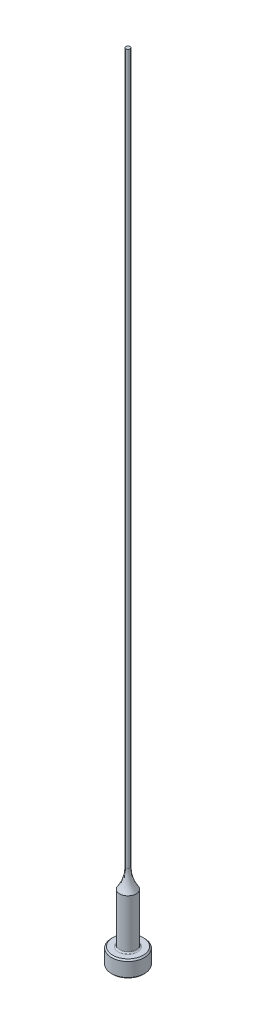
ISO-10303-21;
HEADER;
FILE_DESCRIPTION(('STEP AP214'),'2;1');
FILE_NAME('part.step','',(''),(''),'','','');
FILE_SCHEMA(('AUTOMOTIVE_DESIGN { 1 0 10303 214 1 1 1 1 }'));
ENDSEC;
DATA;
#1=APPLICATION_CONTEXT('core data for automotive mechanical design processes');
#2=APPLICATION_PROTOCOL_DEFINITION('international standard','automotive_design',2000,#1);
#3=PRODUCT_CONTEXT('',#1,'mechanical');
#4=PRODUCT('Part','Part','',(#3));
#5=PRODUCT_RELATED_PRODUCT_CATEGORY('part','',(#4));
#6=PRODUCT_DEFINITION_FORMATION('','',#4);
#7=PRODUCT_DEFINITION_CONTEXT('part definition',#1,'design');
#8=PRODUCT_DEFINITION('design','',#6,#7);
#9=PRODUCT_DEFINITION_SHAPE('','',#8);
#10=(LENGTH_UNIT() NAMED_UNIT(*) SI_UNIT(.MILLI.,.METRE.));
#11=(NAMED_UNIT(*) PLANE_ANGLE_UNIT() SI_UNIT($,.RADIAN.));
#12=(NAMED_UNIT(*) SI_UNIT($,.STERADIAN.) SOLID_ANGLE_UNIT());
#13=UNCERTAINTY_MEASURE_WITH_UNIT(LENGTH_MEASURE(1.E-05),#10,'distance_accuracy_value','');
#14=(GEOMETRIC_REPRESENTATION_CONTEXT(3) GLOBAL_UNCERTAINTY_ASSIGNED_CONTEXT((#13)) GLOBAL_UNIT_ASSIGNED_CONTEXT((#10,
#11,#12)) REPRESENTATION_CONTEXT('',''));
#15=CARTESIAN_POINT('',(0.,0.,0.));
#16=DIRECTION('',(0.,0.,1.));
#17=DIRECTION('',(1.,0.,0.));
#18=AXIS2_PLACEMENT_3D('',#15,#16,#17);
#19=CARTESIAN_POINT('',(-0.396239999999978,152.4,0.));
#20=DIRECTION('',(0.,1.,0.));
#21=DIRECTION('',(0.,0.,1.));
#22=AXIS2_PLACEMENT_3D('',#19,#20,#21);
#23=PLANE('',#22);
#24=CARTESIAN_POINT('',(0.,152.4,0.));
#25=DIRECTION('',(0.,1.,0.));
#26=DIRECTION('',(0.,0.,1.));
#27=AXIS2_PLACEMENT_3D('',#24,#25,#26);
#28=CIRCLE('',#27,0.396239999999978);
#29=CARTESIAN_POINT('',(0.,152.4,0.396239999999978));
#30=VERTEX_POINT('',#29);
#31=EDGE_CURVE('E56',#30,#30,#28,.T.);
#32=ORIENTED_EDGE('',*,*,#31,.T.);
#33=EDGE_LOOP('',(#32));
#34=FACE_BOUND('',#33,.T.);
#35=ADVANCED_FACE('F30',(#34),#23,.T.);
#36=CARTESIAN_POINT('',(0.,259.958771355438,0.));
#37=DIRECTION('',(0.,1.,0.));
#38=DIRECTION('',(0.,0.,1.));
#39=AXIS2_PLACEMENT_3D('',#36,#37,#38);
#40=CYLINDRICAL_SURFACE('',#39,0.396239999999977);
#41=CARTESIAN_POINT('',(0.,16.4026884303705,0.));
#42=DIRECTION('',(0.,1.,0.));
#43=DIRECTION('',(0.,0.,1.));
#44=AXIS2_PLACEMENT_3D('',#41,#42,#43);
#45=CIRCLE('',#44,0.396239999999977);
#46=CARTESIAN_POINT('',(0.,16.4026884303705,0.396239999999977));
#47=VERTEX_POINT('',#46);
#48=EDGE_CURVE('E59',#47,#47,#45,.T.);
#49=ORIENTED_EDGE('',*,*,#48,.T.);
#50=EDGE_LOOP('',(#49));
#51=FACE_BOUND('',#50,.T.);
#52=ORIENTED_EDGE('',*,*,#31,.F.);
#53=EDGE_LOOP('',(#52));
#54=FACE_BOUND('',#53,.T.);
#55=ADVANCED_FACE('F79',(#51,#54),#40,.T.);
#56=CARTESIAN_POINT('',(0.,16.4026884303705,0.));
#57=DIRECTION('',(0.,1.,0.));
#58=DIRECTION('',(0.,0.,1.));
#59=AXIS2_PLACEMENT_3D('',#56,#57,#58);
#60=TOROIDAL_SURFACE('',#59,6.74623999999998,6.35);
#61=CARTESIAN_POINT('',(0.,12.7,0.));
#62=DIRECTION('',(0.,1.,0.));
#63=DIRECTION('',(0.,0.,1.));
#64=AXIS2_PLACEMENT_3D('',#61,#62,#63);
#65=CIRCLE('',#64,1.58749999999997);
#66=CARTESIAN_POINT('',(0.,12.7,1.58749999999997));
#67=VERTEX_POINT('',#66);
#68=EDGE_CURVE('E62',#67,#67,#65,.T.);
#69=ORIENTED_EDGE('',*,*,#68,.T.);
#70=EDGE_LOOP('',(#69));
#71=FACE_BOUND('',#70,.T.);
#72=ORIENTED_EDGE('',*,*,#48,.F.);
#73=EDGE_LOOP('',(#72));
#74=FACE_BOUND('',#73,.T.);
#75=ADVANCED_FACE('F66',(#71,#74),#60,.F.);
#76=CARTESIAN_POINT('',(0.,259.958771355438,0.));
#77=DIRECTION('',(0.,1.,0.));
#78=DIRECTION('',(0.,0.,1.));
#79=AXIS2_PLACEMENT_3D('',#76,#77,#78);
#80=CYLINDRICAL_SURFACE('',#79,1.58749999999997);
#81=CARTESIAN_POINT('',(0.,3.42900000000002,0.));
#82=DIRECTION('',(0.,1.,0.));
#83=DIRECTION('',(0.,0.,1.));
#84=AXIS2_PLACEMENT_3D('',#81,#82,#83);
#85=CIRCLE('',#84,1.58749999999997);
#86=CARTESIAN_POINT('',(0.,3.42900000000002,1.58749999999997));
#87=VERTEX_POINT('',#86);
#88=EDGE_CURVE('E37',#87,#87,#85,.T.);
#89=ORIENTED_EDGE('',*,*,#88,.T.);
#90=EDGE_LOOP('',(#89));
#91=FACE_BOUND('',#90,.T.);
#92=ORIENTED_EDGE('',*,*,#68,.F.);
#93=EDGE_LOOP('',(#92));
#94=FACE_BOUND('',#93,.T.);
#95=ADVANCED_FACE('F69',(#91,#94),#80,.T.);
#96=CARTESIAN_POINT('',(-3.17499999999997,3.175,0.));
#97=DIRECTION('',(0.,1.,0.));
#98=DIRECTION('',(0.,0.,1.));
#99=AXIS2_PLACEMENT_3D('',#96,#97,#98);
#100=PLANE('',#99);
#101=CARTESIAN_POINT('',(0.,3.175,0.));
#102=DIRECTION('',(0.,1.,0.));
#103=DIRECTION('',(0.,0.,1.));
#104=AXIS2_PLACEMENT_3D('',#101,#102,#103);
#105=CIRCLE('',#104,1.84149999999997);
#106=CARTESIAN_POINT('',(0.,3.175,1.84149999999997));
#107=VERTEX_POINT('',#106);
#108=EDGE_CURVE('E10',#107,#107,#105,.F.);
#109=ORIENTED_EDGE('',*,*,#108,.T.);
#110=EDGE_LOOP('',(#109));
#111=FACE_BOUND('',#110,.T.);
#112=CARTESIAN_POINT('',(0.,3.175,0.));
#113=DIRECTION('',(0.,1.,0.));
#114=DIRECTION('',(0.,0.,1.));
#115=AXIS2_PLACEMENT_3D('',#112,#113,#114);
#116=CIRCLE('',#115,2.92099999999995);
#117=CARTESIAN_POINT('',(0.,3.175,2.92099999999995));
#118=VERTEX_POINT('',#117);
#119=EDGE_CURVE('E53',#118,#118,#116,.T.);
#120=ORIENTED_EDGE('',*,*,#119,.T.);
#121=EDGE_LOOP('',(#120));
#122=FACE_BOUND('',#121,.T.);
#123=ADVANCED_FACE('F71',(#111,#122),#100,.T.);
#124=CARTESIAN_POINT('',(0.,259.958771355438,0.));
#125=DIRECTION('',(0.,1.,0.));
#126=DIRECTION('',(0.,0.,1.));
#127=AXIS2_PLACEMENT_3D('',#124,#125,#126);
#128=CYLINDRICAL_SURFACE('',#127,3.17499999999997);
#129=CARTESIAN_POINT('',(0.,2.92100000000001,0.));
#130=DIRECTION('',(0.,1.,0.));
#131=DIRECTION('',(0.,0.,1.));
#132=AXIS2_PLACEMENT_3D('',#129,#130,#131);
#133=CIRCLE('',#132,3.17499999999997);
#134=CARTESIAN_POINT('',(0.,2.92100000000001,3.17499999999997));
#135=VERTEX_POINT('',#134);
#136=EDGE_CURVE('E45',#135,#135,#133,.F.);
#137=ORIENTED_EDGE('',*,*,#136,.T.);
#138=EDGE_LOOP('',(#137));
#139=FACE_BOUND('',#138,.T.);
#140=CARTESIAN_POINT('',(0.,0.254000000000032,0.));
#141=DIRECTION('',(0.,-1.,0.));
#142=DIRECTION('',(0.,0.,-1.));
#143=AXIS2_PLACEMENT_3D('',#140,#141,#142);
#144=CIRCLE('',#143,3.17499999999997);
#145=CARTESIAN_POINT('',(0.,0.254000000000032,-3.17499999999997));
#146=VERTEX_POINT('',#145);
#147=EDGE_CURVE('E50',#146,#146,#144,.F.);
#148=ORIENTED_EDGE('',*,*,#147,.T.);
#149=EDGE_LOOP('',(#148));
#150=FACE_BOUND('',#149,.T.);
#151=ADVANCED_FACE('F77',(#139,#150),#128,.T.);
#152=CARTESIAN_POINT('',(0.,0.,0.));
#153=DIRECTION('',(0.,-1.,0.));
#154=DIRECTION('',(0.,0.,-1.));
#155=AXIS2_PLACEMENT_3D('',#152,#153,#154);
#156=PLANE('',#155);
#157=CARTESIAN_POINT('',(0.,0.,0.));
#158=DIRECTION('',(0.,-1.,0.));
#159=DIRECTION('',(0.,0.,-1.));
#160=AXIS2_PLACEMENT_3D('',#157,#158,#159);
#161=CIRCLE('',#160,2.92099999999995);
#162=CARTESIAN_POINT('',(0.,0.,-2.92099999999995));
#163=VERTEX_POINT('',#162);
#164=EDGE_CURVE('E41',#163,#163,#161,.T.);
#165=ORIENTED_EDGE('',*,*,#164,.T.);
#166=EDGE_LOOP('',(#165));
#167=FACE_BOUND('',#166,.T.);
#168=ADVANCED_FACE('F93',(#167),#156,.T.);
#169=CARTESIAN_POINT('',(0.,3.17499999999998,0.));
#170=DIRECTION('',(0.,-1.,0.));
#171=DIRECTION('',(0.,0.,-1.));
#172=AXIS2_PLACEMENT_3D('',#169,#170,#171);
#173=CONICAL_SURFACE('',#172,2.92099999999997,0.7853981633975);
#174=ORIENTED_EDGE('',*,*,#136,.F.);
#175=EDGE_LOOP('',(#174));
#176=FACE_BOUND('',#175,.T.);
#177=ORIENTED_EDGE('',*,*,#119,.F.);
#178=EDGE_LOOP('',(#177));
#179=FACE_BOUND('',#178,.T.);
#180=ADVANCED_FACE('F90',(#176,#179),#173,.T.);
#181=CARTESIAN_POINT('',(0.,0.254000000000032,0.));
#182=DIRECTION('',(0.,1.,0.));
#183=DIRECTION('',(0.,0.,1.));
#184=AXIS2_PLACEMENT_3D('',#181,#182,#183);
#185=CONICAL_SURFACE('',#184,3.17499999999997,0.785398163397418);
#186=ORIENTED_EDGE('',*,*,#164,.F.);
#187=EDGE_LOOP('',(#186));
#188=FACE_BOUND('',#187,.T.);
#189=ORIENTED_EDGE('',*,*,#147,.F.);
#190=EDGE_LOOP('',(#189));
#191=FACE_BOUND('',#190,.T.);
#192=ADVANCED_FACE('F92',(#188,#191),#185,.T.);
#193=CARTESIAN_POINT('',(0.,3.42900000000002,0.));
#194=DIRECTION('',(0.,1.,0.));
#195=DIRECTION('',(0.,0.,1.));
#196=AXIS2_PLACEMENT_3D('',#193,#194,#195);
#197=TOROIDAL_SURFACE('',#196,1.84149999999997,0.254);
#198=ORIENTED_EDGE('',*,*,#108,.F.);
#199=EDGE_LOOP('',(#198));
#200=FACE_BOUND('',#199,.T.);
#201=ORIENTED_EDGE('',*,*,#88,.F.);
#202=EDGE_LOOP('',(#201));
#203=FACE_BOUND('',#202,.T.);
#204=ADVANCED_FACE('F32',(#200,#203),#197,.F.);
#205=CLOSED_SHELL('',(#35,#55,#75,#95,#123,#151,#168,#180,#192,#204));
#206=MANIFOLD_SOLID_BREP('B2',#205);
#207=ADVANCED_BREP_SHAPE_REPRESENTATION('',(#18,#206),#14);
#208=SHAPE_DEFINITION_REPRESENTATION(#9,#207);
ENDSEC;
END-ISO-10303-21;
